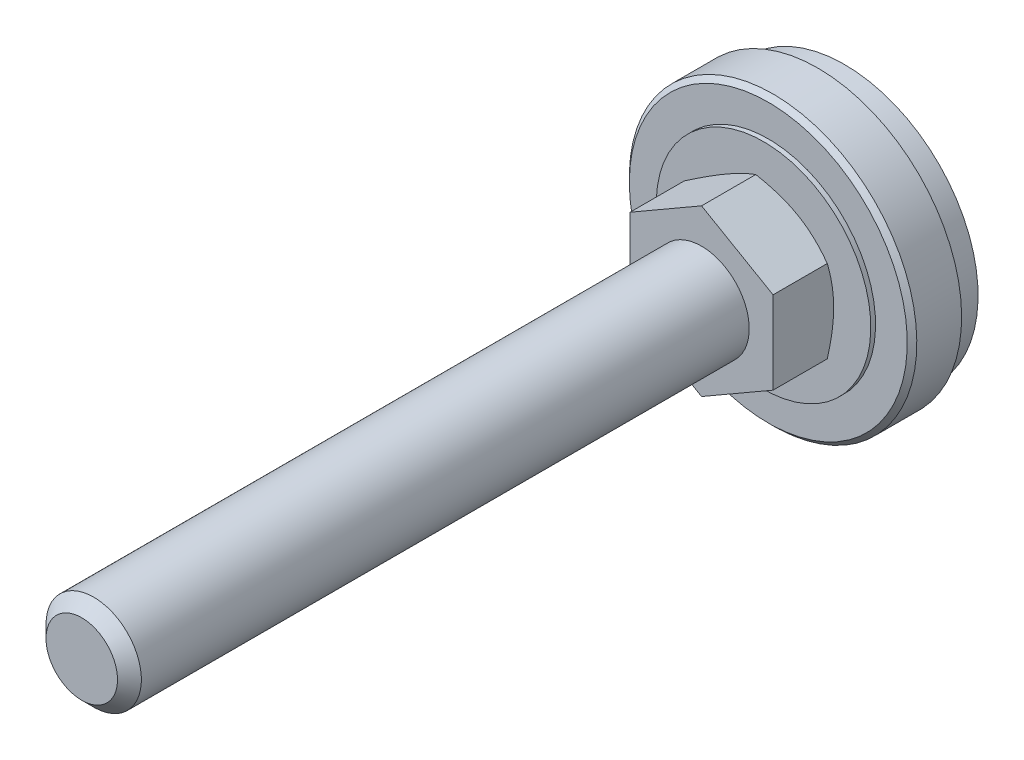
ISO-10303-21;
HEADER;
FILE_DESCRIPTION(('STEP AP214'),'2;1');
FILE_NAME('part.step','',(''),(''),'','','');
FILE_SCHEMA(('AUTOMOTIVE_DESIGN { 1 0 10303 214 1 1 1 1 }'));
ENDSEC;
DATA;
#1=APPLICATION_CONTEXT('core data for automotive mechanical design processes');
#2=APPLICATION_PROTOCOL_DEFINITION('international standard','automotive_design',2000,#1);
#3=PRODUCT_CONTEXT('',#1,'mechanical');
#4=PRODUCT('Part','Part','',(#3));
#5=PRODUCT_RELATED_PRODUCT_CATEGORY('part','',(#4));
#6=PRODUCT_DEFINITION_FORMATION('','',#4);
#7=PRODUCT_DEFINITION_CONTEXT('part definition',#1,'design');
#8=PRODUCT_DEFINITION('design','',#6,#7);
#9=PRODUCT_DEFINITION_SHAPE('','',#8);
#10=(LENGTH_UNIT() NAMED_UNIT(*) SI_UNIT(.MILLI.,.METRE.));
#11=(NAMED_UNIT(*) PLANE_ANGLE_UNIT() SI_UNIT($,.RADIAN.));
#12=(NAMED_UNIT(*) SI_UNIT($,.STERADIAN.) SOLID_ANGLE_UNIT());
#13=UNCERTAINTY_MEASURE_WITH_UNIT(LENGTH_MEASURE(1.E-05),#10,'distance_accuracy_value','');
#14=(GEOMETRIC_REPRESENTATION_CONTEXT(3) GLOBAL_UNCERTAINTY_ASSIGNED_CONTEXT((#13)) GLOBAL_UNIT_ASSIGNED_CONTEXT((#10,
#11,#12)) REPRESENTATION_CONTEXT('',''));
#15=CARTESIAN_POINT('',(0.,0.,0.));
#16=DIRECTION('',(0.,0.,1.));
#17=DIRECTION('',(1.,0.,0.));
#18=AXIS2_PLACEMENT_3D('',#15,#16,#17);
#19=CARTESIAN_POINT('',(0.,0.,30.));
#20=DIRECTION('',(0.,0.,1.));
#21=DIRECTION('',(0.5,-0.866025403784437,0.));
#22=AXIS2_PLACEMENT_3D('',#19,#20,#21);
#23=PLANE('',#22);
#24=DIRECTION('',(0.,1.,0.));
#25=VECTOR('',#24,1.);
#26=CARTESIAN_POINT('',(15.,-8.66025403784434,30.));
#27=LINE('',#26,#25);
#28=CARTESIAN_POINT('',(15.,-8.66025403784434,30.));
#29=VERTEX_POINT('',#28);
#30=CARTESIAN_POINT('',(15.,8.66025403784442,30.));
#31=VERTEX_POINT('',#30);
#32=EDGE_CURVE('E226',#29,#31,#27,.T.);
#33=ORIENTED_EDGE('',*,*,#32,.T.);
#34=DIRECTION('',(-0.86602540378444,0.5,0.));
#35=VECTOR('',#34,1.);
#36=CARTESIAN_POINT('',(15.,8.66025403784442,30.));
#37=LINE('',#36,#35);
#38=CARTESIAN_POINT('',(0.,17.3205080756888,30.));
#39=VERTEX_POINT('',#38);
#40=EDGE_CURVE('E373',#31,#39,#37,.T.);
#41=ORIENTED_EDGE('',*,*,#40,.T.);
#42=DIRECTION('',(-0.866025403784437,-0.5,0.));
#43=VECTOR('',#42,1.);
#44=CARTESIAN_POINT('',(0.,17.3205080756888,30.));
#45=LINE('',#44,#43);
#46=CARTESIAN_POINT('',(-15.,8.66025403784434,30.));
#47=VERTEX_POINT('',#46);
#48=EDGE_CURVE('E372',#39,#47,#45,.T.);
#49=ORIENTED_EDGE('',*,*,#48,.T.);
#50=DIRECTION('',(0.,-1.,0.));
#51=VECTOR('',#50,1.);
#52=CARTESIAN_POINT('',(-15.,8.66025403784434,30.));
#53=LINE('',#52,#51);
#54=CARTESIAN_POINT('',(-15.,-8.66025403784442,30.));
#55=VERTEX_POINT('',#54);
#56=EDGE_CURVE('E377',#47,#55,#53,.T.);
#57=ORIENTED_EDGE('',*,*,#56,.T.);
#58=DIRECTION('',(0.86602540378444,-0.5,0.));
#59=VECTOR('',#58,1.);
#60=CARTESIAN_POINT('',(-15.,-8.66025403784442,30.));
#61=LINE('',#60,#59);
#62=CARTESIAN_POINT('',(0.,-17.3205080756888,30.));
#63=VERTEX_POINT('',#62);
#64=EDGE_CURVE('E379',#55,#63,#61,.T.);
#65=ORIENTED_EDGE('',*,*,#64,.T.);
#66=DIRECTION('',(0.866025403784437,0.5,0.));
#67=VECTOR('',#66,1.);
#68=CARTESIAN_POINT('',(0.,-17.3205080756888,30.));
#69=LINE('',#68,#67);
#70=EDGE_CURVE('E37',#63,#29,#69,.T.);
#71=ORIENTED_EDGE('',*,*,#70,.T.);
#72=EDGE_LOOP('',(#33,#41,#49,#57,#65,#71));
#73=FACE_BOUND('',#72,.T.);
#74=CARTESIAN_POINT('',(0.,0.,30.));
#75=DIRECTION('',(0.,0.,1.));
#76=DIRECTION('',(0.5,-0.866025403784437,0.));
#77=AXIS2_PLACEMENT_3D('',#74,#75,#76);
#78=CIRCLE('',#77,10.);
#79=CARTESIAN_POINT('',(5.,-8.66025403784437,30.));
#80=VERTEX_POINT('',#79);
#81=EDGE_CURVE('E230',#80,#80,#78,.T.);
#82=ORIENTED_EDGE('',*,*,#81,.F.);
#83=EDGE_LOOP('',(#82));
#84=FACE_BOUND('',#83,.T.);
#85=ADVANCED_FACE('F14',(#73,#84),#23,.T.);
#86=CARTESIAN_POINT('',(-11.25,19.4855715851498,17.));
#87=DIRECTION('',(0.,0.,1.));
#88=DIRECTION('',(0.5,-0.866025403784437,0.));
#89=AXIS2_PLACEMENT_3D('',#86,#87,#88);
#90=PLANE('',#89);
#91=CARTESIAN_POINT('',(0.,0.,17.));
#92=DIRECTION('',(0.,0.,1.));
#93=DIRECTION('',(0.5,-0.866025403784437,0.));
#94=AXIS2_PLACEMENT_3D('',#91,#92,#93);
#95=CIRCLE('',#94,22.5);
#96=CARTESIAN_POINT('',(11.25,-19.4855715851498,17.));
#97=VERTEX_POINT('',#96);
#98=EDGE_CURVE('E102',#97,#97,#95,.T.);
#99=ORIENTED_EDGE('',*,*,#98,.T.);
#100=EDGE_LOOP('',(#99));
#101=FACE_BOUND('',#100,.T.);
#102=CARTESIAN_POINT('',(0.,0.,17.));
#103=DIRECTION('',(0.,0.,-1.));
#104=DIRECTION('',(-0.5,0.866025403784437,0.));
#105=AXIS2_PLACEMENT_3D('',#102,#103,#104);
#106=CIRCLE('',#105,14.5);
#107=CARTESIAN_POINT('',(-7.25,12.5573683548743,17.));
#108=VERTEX_POINT('',#107);
#109=EDGE_CURVE('E84',#108,#108,#106,.T.);
#110=ORIENTED_EDGE('',*,*,#109,.T.);
#111=EDGE_LOOP('',(#110));
#112=FACE_BOUND('',#111,.T.);
#113=ADVANCED_FACE('F186',(#101,#112),#90,.T.);
#114=CARTESIAN_POINT('',(0.,0.,0.));
#115=DIRECTION('',(0.,0.,-1.));
#116=DIRECTION('',(-0.5,0.866025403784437,0.));
#117=AXIS2_PLACEMENT_3D('',#114,#115,#116);
#118=PLANE('',#117);
#119=CARTESIAN_POINT('',(0.,0.,0.));
#120=DIRECTION('',(0.,0.,1.));
#121=DIRECTION('',(0.5,-0.866025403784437,0.));
#122=AXIS2_PLACEMENT_3D('',#119,#120,#121);
#123=CIRCLE('',#122,28.);
#124=CARTESIAN_POINT('',(14.,-24.2487113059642,0.));
#125=VERTEX_POINT('',#124);
#126=EDGE_CURVE('E73',#125,#125,#123,.T.);
#127=ORIENTED_EDGE('',*,*,#126,.F.);
#128=EDGE_LOOP('',(#127));
#129=FACE_BOUND('',#128,.T.);
#130=ADVANCED_FACE('F189',(#129),#118,.T.);
#131=CARTESIAN_POINT('',(0.,0.,134.742297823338));
#132=DIRECTION('',(0.,0.,1.));
#133=DIRECTION('',(0.5,-0.866025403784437,0.));
#134=AXIS2_PLACEMENT_3D('',#131,#132,#133);
#135=CYLINDRICAL_SURFACE('',#134,28.);
#136=ORIENTED_EDGE('',*,*,#126,.T.);
#137=EDGE_LOOP('',(#136));
#138=FACE_BOUND('',#137,.T.);
#139=CARTESIAN_POINT('',(0.,0.,5.6));
#140=DIRECTION('',(0.,0.,1.));
#141=DIRECTION('',(0.5,-0.866025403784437,0.));
#142=AXIS2_PLACEMENT_3D('',#139,#140,#141);
#143=CIRCLE('',#142,28.);
#144=CARTESIAN_POINT('',(14.,-24.2487113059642,5.6));
#145=VERTEX_POINT('',#144);
#146=EDGE_CURVE('E117',#145,#145,#143,.T.);
#147=ORIENTED_EDGE('',*,*,#146,.F.);
#148=EDGE_LOOP('',(#147));
#149=FACE_BOUND('',#148,.T.);
#150=ADVANCED_FACE('F209',(#138,#149),#135,.T.);
#151=CARTESIAN_POINT('',(-15.075,26.1106659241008,5.6));
#152=DIRECTION('',(0.,0.,-1.));
#153=DIRECTION('',(-0.5,0.866025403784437,0.));
#154=AXIS2_PLACEMENT_3D('',#151,#152,#153);
#155=PLANE('',#154);
#156=ORIENTED_EDGE('',*,*,#146,.T.);
#157=EDGE_LOOP('',(#156));
#158=FACE_BOUND('',#157,.T.);
#159=CARTESIAN_POINT('',(0.,0.,5.6));
#160=DIRECTION('',(0.,0.,1.));
#161=DIRECTION('',(0.5,-0.866025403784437,0.));
#162=AXIS2_PLACEMENT_3D('',#159,#160,#161);
#163=CIRCLE('',#162,30.15);
#164=CARTESIAN_POINT('',(15.075,-26.1106659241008,5.6));
#165=VERTEX_POINT('',#164);
#166=EDGE_CURVE('E114',#165,#165,#163,.T.);
#167=ORIENTED_EDGE('',*,*,#166,.F.);
#168=EDGE_LOOP('',(#167));
#169=FACE_BOUND('',#168,.T.);
#170=ADVANCED_FACE('F205',(#158,#169),#155,.T.);
#171=CARTESIAN_POINT('',(0.,0.,134.742297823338));
#172=DIRECTION('',(0.,0.,1.));
#173=DIRECTION('',(0.5,-0.866025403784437,0.));
#174=AXIS2_PLACEMENT_3D('',#171,#172,#173);
#175=CYLINDRICAL_SURFACE('',#174,30.15);
#176=ORIENTED_EDGE('',*,*,#166,.T.);
#177=EDGE_LOOP('',(#176));
#178=FACE_BOUND('',#177,.T.);
#179=CARTESIAN_POINT('',(0.,0.,15.));
#180=DIRECTION('',(0.,0.,1.));
#181=DIRECTION('',(0.5,-0.866025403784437,0.));
#182=AXIS2_PLACEMENT_3D('',#179,#180,#181);
#183=CIRCLE('',#182,30.15);
#184=CARTESIAN_POINT('',(15.075,-26.1106659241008,15.));
#185=VERTEX_POINT('',#184);
#186=EDGE_CURVE('E111',#185,#185,#183,.T.);
#187=ORIENTED_EDGE('',*,*,#186,.F.);
#188=EDGE_LOOP('',(#187));
#189=FACE_BOUND('',#188,.T.);
#190=ADVANCED_FACE('F201',(#178,#189),#175,.T.);
#191=CARTESIAN_POINT('',(0.,0.,16.));
#192=DIRECTION('',(0.,0.,-1.));
#193=DIRECTION('',(-0.5,0.866025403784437,0.));
#194=AXIS2_PLACEMENT_3D('',#191,#192,#193);
#195=CONICAL_SURFACE('',#194,29.15,0.785398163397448);
#196=ORIENTED_EDGE('',*,*,#186,.T.);
#197=EDGE_LOOP('',(#196));
#198=FACE_BOUND('',#197,.T.);
#199=CARTESIAN_POINT('',(0.,0.,16.));
#200=DIRECTION('',(0.,0.,1.));
#201=DIRECTION('',(0.5,-0.866025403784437,0.));
#202=AXIS2_PLACEMENT_3D('',#199,#200,#201);
#203=CIRCLE('',#202,29.15);
#204=CARTESIAN_POINT('',(14.575,-25.2446405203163,16.));
#205=VERTEX_POINT('',#204);
#206=EDGE_CURVE('E108',#205,#205,#203,.T.);
#207=ORIENTED_EDGE('',*,*,#206,.F.);
#208=EDGE_LOOP('',(#207));
#209=FACE_BOUND('',#208,.T.);
#210=ADVANCED_FACE('F197',(#198,#209),#195,.T.);
#211=CARTESIAN_POINT('',(-14.575,25.2446405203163,16.));
#212=DIRECTION('',(0.,0.,1.));
#213=DIRECTION('',(0.5,-0.866025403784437,0.));
#214=AXIS2_PLACEMENT_3D('',#211,#212,#213);
#215=PLANE('',#214);
#216=ORIENTED_EDGE('',*,*,#206,.T.);
#217=EDGE_LOOP('',(#216));
#218=FACE_BOUND('',#217,.T.);
#219=CARTESIAN_POINT('',(0.,0.,16.));
#220=DIRECTION('',(0.,0.,1.));
#221=DIRECTION('',(0.5,-0.866025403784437,0.));
#222=AXIS2_PLACEMENT_3D('',#219,#220,#221);
#223=CIRCLE('',#222,22.5);
#224=CARTESIAN_POINT('',(11.25,-19.4855715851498,16.));
#225=VERTEX_POINT('',#224);
#226=EDGE_CURVE('E105',#225,#225,#223,.T.);
#227=ORIENTED_EDGE('',*,*,#226,.F.);
#228=EDGE_LOOP('',(#227));
#229=FACE_BOUND('',#228,.T.);
#230=ADVANCED_FACE('F193',(#218,#229),#215,.T.);
#231=CARTESIAN_POINT('',(0.,0.,134.742297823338));
#232=DIRECTION('',(0.,0.,1.));
#233=DIRECTION('',(0.5,-0.866025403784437,0.));
#234=AXIS2_PLACEMENT_3D('',#231,#232,#233);
#235=CYLINDRICAL_SURFACE('',#234,22.5);
#236=ORIENTED_EDGE('',*,*,#226,.T.);
#237=EDGE_LOOP('',(#236));
#238=FACE_BOUND('',#237,.T.);
#239=ORIENTED_EDGE('',*,*,#98,.F.);
#240=EDGE_LOOP('',(#239));
#241=FACE_BOUND('',#240,.T.);
#242=ADVANCED_FACE('F133',(#238,#241),#235,.T.);
#243=CARTESIAN_POINT('',(0.,0.,22.4252428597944));
#244=DIRECTION('',(0.,0.,1.));
#245=DIRECTION('',(0.5,-0.866025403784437,0.));
#246=AXIS2_PLACEMENT_3D('',#243,#244,#245);
#247=CONICAL_SURFACE('',#246,23.8967962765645,1.0471975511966);
#248=ORIENTED_EDGE('',*,*,#109,.F.);
#249=EDGE_LOOP('',(#248));
#250=FACE_BOUND('',#249,.T.);
#251=CARTESIAN_POINT('',(-12.8156002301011,-24.7195983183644,24.7042637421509));
#252=CARTESIAN_POINT('',(-12.531199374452,-24.5553994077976,24.5445303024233));
#253=CARTESIAN_POINT('',(-12.2464693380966,-24.3910104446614,24.3855786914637));
#254=CARTESIAN_POINT('',(-11.6762822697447,-24.0618127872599,24.0694158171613));
#255=CARTESIAN_POINT('',(-11.3908252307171,-23.8970040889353,23.9122045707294));
#256=CARTESIAN_POINT('',(-10.5331869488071,-23.4018463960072,23.443406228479));
#257=CARTESIAN_POINT('',(-9.95982008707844,-23.0708128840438,23.1347004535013));
#258=CARTESIAN_POINT('',(-8.80626593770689,-22.4048080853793,22.5251819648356));
#259=CARTESIAN_POINT('',(-8.22605861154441,-22.0698252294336,22.2244196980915));
#260=CARTESIAN_POINT('',(-7.06108881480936,-21.3972296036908,21.6349394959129));
#261=CARTESIAN_POINT('',(-6.47632655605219,-21.0596169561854,21.3462210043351));
#262=CARTESIAN_POINT('',(-5.28180185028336,-20.3699577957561,20.7746714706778));
#263=CARTESIAN_POINT('',(-4.67185404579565,-20.0178042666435,20.49235431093));
#264=CARTESIAN_POINT('',(-3.44488115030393,-19.309411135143,19.9486150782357));
#265=CARTESIAN_POINT('',(-2.82785528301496,-18.9531710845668,19.6871953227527));
#266=CARTESIAN_POINT('',(-1.58686537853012,-18.2366852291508,19.1919746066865));
#267=CARTESIAN_POINT('',(-0.96291770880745,-17.8764488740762,18.9581193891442));
#268=CARTESIAN_POINT('',(0.293985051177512,-17.1507757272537,18.5253878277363));
#269=CARTESIAN_POINT('',(0.926937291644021,-16.7853405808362,18.3265006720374));
#270=CARTESIAN_POINT('',(1.88148437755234,-16.2342325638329,18.0620414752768));
#271=CARTESIAN_POINT('',(2.19961844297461,-16.0505577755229,17.9797180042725));
#272=CARTESIAN_POINT('',(2.83809132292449,-15.6819352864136,17.8273230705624));
#273=CARTESIAN_POINT('',(3.15843009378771,-15.4969876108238,17.757251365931));
#274=CARTESIAN_POINT('',(3.80110433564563,-15.1259394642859,17.6305843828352));
#275=CARTESIAN_POINT('',(4.12343977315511,-14.9398390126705,17.5739888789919));
#276=CARTESIAN_POINT('',(4.76977798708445,-14.5666754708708,17.4753959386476));
#277=CARTESIAN_POINT('',(5.09378068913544,-14.3796124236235,17.4333978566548));
#278=CARTESIAN_POINT('',(5.73869803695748,-14.0072692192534,17.3653714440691));
#279=CARTESIAN_POINT('',(6.05959634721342,-13.8219984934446,17.3391378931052));
#280=CARTESIAN_POINT('',(6.70206615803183,-13.4510683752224,17.3023738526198));
#281=CARTESIAN_POINT('',(7.02363764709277,-13.2654089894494,17.2918430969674));
#282=CARTESIAN_POINT('',(7.66687876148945,-12.8940335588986,17.2867359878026));
#283=CARTESIAN_POINT('',(7.98854838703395,-12.7083175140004,17.2921596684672));
#284=CARTESIAN_POINT('',(8.63139929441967,-12.3371673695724,17.3188268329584));
#285=CARTESIAN_POINT('',(8.95258055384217,-12.1517332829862,17.3400710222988));
#286=CARTESIAN_POINT('',(9.71937227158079,-11.7090258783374,17.4092190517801));
#287=CARTESIAN_POINT('',(10.1645061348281,-11.4520277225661,17.4643010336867));
#288=CARTESIAN_POINT('',(11.0515840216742,-10.9398730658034,17.6018992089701));
#289=CARTESIAN_POINT('',(11.4935276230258,-10.6847168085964,17.6844189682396));
#290=CARTESIAN_POINT('',(12.3737638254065,-10.1765122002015,17.8739575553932));
#291=CARTESIAN_POINT('',(12.8120534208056,-9.92346558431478,17.9809948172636));
#292=CARTESIAN_POINT('',(13.6842925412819,-9.41987809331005,18.2162917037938));
#293=CARTESIAN_POINT('',(14.1182421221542,-9.16933718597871,18.3445510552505));
#294=CARTESIAN_POINT('',(14.9915095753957,-8.66515598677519,18.6222437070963));
#295=CARTESIAN_POINT('',(15.4307286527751,-8.41157273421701,18.7720883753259));
#296=CARTESIAN_POINT('',(16.3048424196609,-7.90690291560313,19.0876591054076));
#297=CARTESIAN_POINT('',(16.7397370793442,-7.65581636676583,19.253385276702));
#298=CARTESIAN_POINT('',(17.605411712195,-7.15601888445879,19.5980527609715));
#299=CARTESIAN_POINT('',(18.0361929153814,-6.90730724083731,19.7769899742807));
#300=CARTESIAN_POINT('',(18.8941620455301,-6.41195853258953,20.1459352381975));
#301=CARTESIAN_POINT('',(19.3213500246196,-6.16532143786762,20.335943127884));
#302=CARTESIAN_POINT('',(20.3671937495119,-5.56150328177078,20.8142166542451));
#303=CARTESIAN_POINT('',(20.9840653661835,-5.20535228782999,21.1076776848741));
#304=CARTESIAN_POINT('',(22.21222970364,-4.49627127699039,21.7098205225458));
#305=CARTESIAN_POINT('',(22.8235220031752,-4.14334150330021,22.0185034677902));
#306=CARTESIAN_POINT('',(24.041630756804,-3.44006608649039,22.64789067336));
#307=CARTESIAN_POINT('',(24.6484459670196,-3.08972116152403,22.9685981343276));
#308=CARTESIAN_POINT('',(25.8582248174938,-2.39125501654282,23.6194839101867));
#309=CARTESIAN_POINT('',(26.4611885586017,-2.0431337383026,23.9496619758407));
#310=CARTESIAN_POINT('',(27.6646871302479,-1.34829351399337,24.6180526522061));
#311=CARTESIAN_POINT('',(28.2652179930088,-1.00157685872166,24.9562747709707));
#312=CARTESIAN_POINT('',(29.4636269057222,-0.309675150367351,25.6389282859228));
#313=CARTESIAN_POINT('',(30.0615049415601,0.0355098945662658,25.9833597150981));
#314=CARTESIAN_POINT('',(31.2549440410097,0.724542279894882,26.6772703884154));
#315=CARTESIAN_POINT('',(31.8505054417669,1.06838981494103,27.0267488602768));
#316=CARTESIAN_POINT('',(33.0397454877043,1.75499787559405,27.729943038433));
#317=CARTESIAN_POINT('',(33.633424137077,2.0977584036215,28.0836587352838));
#318=CARTESIAN_POINT('',(35.3053941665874,3.06307075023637,29.0861455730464));
#319=CARTESIAN_POINT('',(36.3818468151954,3.68456097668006,29.7390052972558));
#320=CARTESIAN_POINT('',(38.5308195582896,4.92527096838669,31.0534039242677));
#321=CARTESIAN_POINT('',(39.6033394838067,5.54449063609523,31.7149431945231));
#322=CARTESIAN_POINT('',(41.7423385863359,6.77944234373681,33.0427714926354));
#323=CARTESIAN_POINT('',(42.8088262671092,7.3951792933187,33.7090422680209));
#324=CARTESIAN_POINT('',(44.4067215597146,8.31772457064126,34.7122533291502));
#325=CARTESIAN_POINT('',(44.9390311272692,8.62505364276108,35.0472809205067));
#326=CARTESIAN_POINT('',(46.0031101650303,9.23939996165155,35.7184756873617));
#327=CARTESIAN_POINT('',(46.5348796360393,9.54641720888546,36.054642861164));
#328=CARTESIAN_POINT('',(47.0664104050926,9.85329664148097,36.3913126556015));
#329=B_SPLINE_CURVE_WITH_KNOTS('',3,(#251,#252,#253,#254,#255,#256,#257,#258,#259,#260,#261,
#262,#263,#264,#265,#266,#267,#268,#269,#270,#271,#272,#273,#274,#275,#276,#277,#278,#279,#280,
#281,#282,#283,#284,#285,#286,#287,#288,#289,#290,#291,#292,#293,#294,#295,#296,#297,#298,#299,
#300,#301,#302,#303,#304,#305,#306,#307,#308,#309,#310,#311,#312,#313,#314,#315,#316,#317,#318,
#319,#320,#321,#322,#323,#324,#325,#326,#327,#328),.UNSPECIFIED.,.F.,.F.,(4,2,2,2,2,2,2,2,2,2,2,
2,2,2,2,2,2,2,2,2,2,2,2,2,2,2,2,2,2,2,2,2,2,2,2,2,2,2,4),(0.,1.0955523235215,2.19111528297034,
4.38255547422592,6.58559894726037,8.78854057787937,11.0646358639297,13.340983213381,
15.612772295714,17.8838577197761,19.0130694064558,20.1422587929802,21.2714292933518,
22.400549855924,23.5146339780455,24.6286992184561,25.7427668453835,26.8568841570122,
28.4068489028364,29.9570151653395,31.5083508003,33.059666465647,34.645875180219,
36.2320948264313,37.817824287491,39.4035307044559,41.7144394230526,44.0255212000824,
46.3372225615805,48.6488631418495,50.9633871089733,53.2779233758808,55.5921091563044,
57.9062897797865,62.1182482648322,66.330385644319,70.5308455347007,72.6309477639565,
74.7310468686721),.UNSPECIFIED.);
#330=CARTESIAN_POINT('',(0.,-17.3205080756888,18.6284210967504));
#331=VERTEX_POINT('',#330);
#332=CARTESIAN_POINT('',(15.,-8.66025403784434,18.6284210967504));
#333=VERTEX_POINT('',#332);
#334=EDGE_CURVE('E65',#331,#333,#329,.T.);
#335=ORIENTED_EDGE('',*,*,#334,.F.);
#336=CARTESIAN_POINT('',(-15.0002,-8.66013856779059,18.6284877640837));
#337=CARTESIAN_POINT('',(-14.6705058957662,-8.8504875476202,18.5185969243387));
#338=CARTESIAN_POINT('',(-14.3395258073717,-9.04157899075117,18.4136927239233));
#339=CARTESIAN_POINT('',(-13.674911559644,-9.42529420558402,18.2152437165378));
#340=CARTESIAN_POINT('',(-13.3412765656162,-9.61791845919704,18.1217026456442));
#341=CARTESIAN_POINT('',(-12.6707077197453,-10.0050715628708,17.9472372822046));
#342=CARTESIAN_POINT('',(-12.333767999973,-10.199603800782,17.8663428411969));
#343=CARTESIAN_POINT('',(-11.6575472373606,-10.5900200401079,17.7189077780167));
#344=CARTESIAN_POINT('',(-11.3182663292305,-10.7859039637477,17.652366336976));
#345=CARTESIAN_POINT('',(-10.6460568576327,-11.1740042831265,17.536467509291));
#346=CARTESIAN_POINT('',(-10.3131781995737,-11.3661918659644,17.4867265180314));
#347=CARTESIAN_POINT('',(-9.64589556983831,-11.7514476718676,17.4033218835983));
#348=CARTESIAN_POINT('',(-9.31149156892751,-11.9445159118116,17.3696585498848));
#349=CARTESIAN_POINT('',(-8.64212181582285,-12.3309767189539,17.3192592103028));
#350=CARTESIAN_POINT('',(-8.30715720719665,-12.5243686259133,17.3025030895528));
#351=CARTESIAN_POINT('',(-7.63691878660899,-12.9113309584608,17.2862785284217));
#352=CARTESIAN_POINT('',(-7.30164498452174,-13.1049013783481,17.2868095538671));
#353=CARTESIAN_POINT('',(-6.67485311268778,-13.4667798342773,17.3039517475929));
#354=CARTESIAN_POINT('',(-6.38329037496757,-13.6351136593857,17.3184719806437));
#355=CARTESIAN_POINT('',(-5.80083556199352,-13.9713941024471,17.3603122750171));
#356=CARTESIAN_POINT('',(-5.50994353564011,-14.1393406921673,17.3876332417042));
#357=CARTESIAN_POINT('',(-4.92898814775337,-14.4747554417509,17.4545986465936));
#358=CARTESIAN_POINT('',(-4.63892567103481,-14.6422230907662,17.4942532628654));
#359=CARTESIAN_POINT('',(-4.06016058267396,-14.9763732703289,17.5851902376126));
#360=CARTESIAN_POINT('',(-3.77145806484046,-15.1430557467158,17.636473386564));
#361=CARTESIAN_POINT('',(-2.89508556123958,-15.6490296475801,17.8090619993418));
#362=CARTESIAN_POINT('',(-2.30995340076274,-15.9868558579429,17.9475763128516));
#363=CARTESIAN_POINT('',(-1.14841408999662,-16.6574708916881,18.2619471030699));
#364=CARTESIAN_POINT('',(-0.571992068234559,-16.9902683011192,18.4377297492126));
#365=CARTESIAN_POINT('',(0.000200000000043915,-17.3206235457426,18.6284877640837));
#366=B_SPLINE_CURVE_WITH_KNOTS('',3,(#336,#337,#338,#339,#340,#341,#342,#343,#344,#345,#346,
#347,#348,#349,#350,#351,#352,#353,#354,#355,#356,#357,#358,#359,#360,#361,#362,#363,#364,#365),
.UNSPECIFIED.,.F.,.F.,(4,2,2,2,2,2,2,2,2,2,2,2,2,2,4),(0.,1.18875411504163,2.37789802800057,
3.56980778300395,4.76164951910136,5.92407379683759,7.08652044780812,8.24758247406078,
9.40860862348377,10.4193068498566,11.4300765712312,12.4416826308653,13.4533574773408,
15.5211962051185,17.5849760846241),.UNSPECIFIED.);
#367=CARTESIAN_POINT('',(-15.,-8.66025403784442,18.6284210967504));
#368=VERTEX_POINT('',#367);
#369=EDGE_CURVE('E68',#368,#331,#366,.T.);
#370=ORIENTED_EDGE('',*,*,#369,.F.);
#371=CARTESIAN_POINT('',(-15.,8.66048497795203,18.6284877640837));
#372=CARTESIAN_POINT('',(-15.,8.27978701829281,18.5185969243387));
#373=CARTESIAN_POINT('',(-15.,7.89760413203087,18.4136927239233));
#374=CARTESIAN_POINT('',(-15.,7.13017370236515,18.2152437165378));
#375=CARTESIAN_POINT('',(-15.,6.74492519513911,18.1217026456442));
#376=CARTESIAN_POINT('',(-15.,5.9706189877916,17.9472372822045));
#377=CARTESIAN_POINT('',(-15.,5.58155451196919,17.8663428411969));
#378=CARTESIAN_POINT('',(-15.,4.80072203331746,17.7189077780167));
#379=CARTESIAN_POINT('',(-15.,4.4089541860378,17.652366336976));
#380=CARTESIAN_POINT('',(-15.,3.63275354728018,17.536467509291));
#381=CARTESIAN_POINT('',(-15.,3.24837838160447,17.4867265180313));
#382=CARTESIAN_POINT('',(-15.,2.47786676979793,17.4033218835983));
#383=CARTESIAN_POINT('',(-15.,2.09173028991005,17.3696585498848));
#384=CARTESIAN_POINT('',(-15.,1.31880867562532,17.3192592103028));
#385=CARTESIAN_POINT('',(-15.,0.932024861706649,17.3025030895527));
#386=CARTESIAN_POINT('',(-15.,0.158100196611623,17.2862785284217));
#387=CARTESIAN_POINT('',(-15.,-0.229040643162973,17.2868095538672));
#388=CARTESIAN_POINT('',(-15.,-0.952797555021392,17.3039517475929));
#389=CARTESIAN_POINT('',(-15.,-1.28946520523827,17.3184719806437));
#390=CARTESIAN_POINT('',(-15.,-1.962026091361,17.3603122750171));
#391=CARTESIAN_POINT('',(-15.,-2.29791927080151,17.3876332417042));
#392=CARTESIAN_POINT('',(-15.,-2.96874876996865,17.4545986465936));
#393=CARTESIAN_POINT('',(-15.,-3.30368406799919,17.4942532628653));
#394=CARTESIAN_POINT('',(-15.,-3.97198442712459,17.5851902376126));
#395=CARTESIAN_POINT('',(-15.,-4.30534937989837,17.6364733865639));
#396=CARTESIAN_POINT('',(-15.,-5.31729718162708,17.8090619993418));
#397=CARTESIAN_POINT('',(-15.,-5.99294960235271,17.9475763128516));
#398=CARTESIAN_POINT('',(-15.,-7.334179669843,18.2619471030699));
#399=CARTESIAN_POINT('',(-15.,-7.9997744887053,18.4377297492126));
#400=CARTESIAN_POINT('',(-15.,-8.6604849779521,18.6284877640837));
#401=B_SPLINE_CURVE_WITH_KNOTS('',3,(#371,#372,#373,#374,#375,#376,#377,#378,#379,#380,#381,
#382,#383,#384,#385,#386,#387,#388,#389,#390,#391,#392,#393,#394,#395,#396,#397,#398,#399,#400),
.UNSPECIFIED.,.F.,.F.,(4,2,2,2,2,2,2,2,2,2,2,2,2,2,4),(0.,1.18875411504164,2.37789802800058,
3.56980778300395,4.76164951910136,5.92407379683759,7.08652044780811,8.24758247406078,
9.40860862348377,10.4193068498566,11.4300765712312,12.4416826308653,13.4533574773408,
15.5211962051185,17.5849760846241),.UNSPECIFIED.);
#402=CARTESIAN_POINT('',(-15.,8.66025403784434,18.6284210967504));
#403=VERTEX_POINT('',#402);
#404=EDGE_CURVE('E83',#403,#368,#401,.T.);
#405=ORIENTED_EDGE('',*,*,#404,.F.);
#406=CARTESIAN_POINT('',(-27.8156002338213,1.26116379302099,24.7042637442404));
#407=CARTESIAN_POINT('',(-27.5311993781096,1.42536270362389,24.5445303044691));
#408=CARTESIAN_POINT('',(-27.2464693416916,1.5897516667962,24.3855786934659));
#409=CARTESIAN_POINT('',(-26.6762822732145,1.91894932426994,24.0694158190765));
#410=CARTESIAN_POINT('',(-26.3908252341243,2.08375802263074,23.912204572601));
#411=CARTESIAN_POINT('',(-25.5331869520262,2.57891571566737,23.4434062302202));
#412=CARTESIAN_POINT('',(-24.959820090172,2.9099492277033,23.1347004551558));
#413=CARTESIAN_POINT('',(-23.8062659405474,3.57595402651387,22.5251819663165));
#414=CARTESIAN_POINT('',(-23.2260586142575,3.91093688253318,22.2244196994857));
#415=CARTESIAN_POINT('',(-22.0610888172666,4.58353250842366,21.6349394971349));
#416=CARTESIAN_POINT('',(-21.476326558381,4.92114515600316,21.3462210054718));
#417=CARTESIAN_POINT('',(-20.2818018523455,5.61080431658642,20.7746714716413));
#418=CARTESIAN_POINT('',(-19.6718540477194,5.96295784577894,20.4923543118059));
#419=CARTESIAN_POINT('',(-18.4448811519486,6.67135097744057,19.9486150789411));
#420=CARTESIAN_POINT('',(-17.827855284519,7.02759102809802,19.6871953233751));
#421=CARTESIAN_POINT('',(-16.5868653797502,7.74407688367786,19.1919746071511));
#422=CARTESIAN_POINT('',(-15.9629177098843,8.10431323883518,18.9581193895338));
#423=CARTESIAN_POINT('',(-14.706014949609,8.82998638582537,18.5253878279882));
#424=CARTESIAN_POINT('',(-14.0730627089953,9.19542153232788,18.3265006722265));
#425=CARTESIAN_POINT('',(-13.1185156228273,9.74652954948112,18.062041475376));
#426=CARTESIAN_POINT('',(-12.800381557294,9.93020433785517,17.9797180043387));
#427=CARTESIAN_POINT('',(-12.1619086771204,10.2988268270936,17.8273230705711));
#428=CARTESIAN_POINT('',(-11.8415699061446,10.4837745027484,17.757251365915));
#429=CARTESIAN_POINT('',(-11.1988956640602,10.8548226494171,17.6305843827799));
#430=CARTESIAN_POINT('',(-10.8765602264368,11.0409231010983,17.5739888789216));
#431=CARTESIAN_POINT('',(-10.2302220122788,11.41408664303,17.4753959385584));
#432=CARTESIAN_POINT('',(-9.906219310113,11.6011496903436,17.4333978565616));
#433=CARTESIAN_POINT('',(-9.26130196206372,11.9734928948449,17.3653714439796));
#434=CARTESIAN_POINT('',(-8.94040365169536,12.1587636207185,17.3391378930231));
#435=CARTESIAN_POINT('',(-8.29793384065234,12.5296937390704,17.3023738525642));
#436=CARTESIAN_POINT('',(-7.97636235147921,12.7153531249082,17.2918430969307));
#437=CARTESIAN_POINT('',(-7.33312123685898,13.0867285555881,17.2867359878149));
#438=CARTESIAN_POINT('',(-7.01145161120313,13.2724446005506,17.2921596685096));
#439=CARTESIAN_POINT('',(-6.36860070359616,13.6435947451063,17.3188268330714));
#440=CARTESIAN_POINT('',(-6.04741944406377,13.829028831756,17.3400710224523));
#441=CARTESIAN_POINT('',(-5.28062772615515,14.2717362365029,17.4092190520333));
#442=CARTESIAN_POINT('',(-4.8354938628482,14.5287343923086,17.4643010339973));
#443=CARTESIAN_POINT('',(-3.94841597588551,15.0408890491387,17.6018992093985));
#444=CARTESIAN_POINT('',(-3.50647237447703,15.2960453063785,17.6844189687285));
#445=CARTESIAN_POINT('',(-2.62623617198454,15.804249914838,17.8739575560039));
#446=CARTESIAN_POINT('',(-2.18794657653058,16.0572965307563,17.9809948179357));
#447=CARTESIAN_POINT('',(-1.31570745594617,16.5608840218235,18.2162917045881));
#448=CARTESIAN_POINT('',(-0.88175787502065,16.8114249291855,18.3445510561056));
#449=CARTESIAN_POINT('',(-0.00849042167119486,17.3156061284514,18.6222437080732));
#450=CARTESIAN_POINT('',(0.430728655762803,17.5691893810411,18.772088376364));
#451=CARTESIAN_POINT('',(1.30484242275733,18.0738591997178,19.087659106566));
#452=CARTESIAN_POINT('',(1.73973708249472,18.3249457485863,19.2533852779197));
#453=CARTESIAN_POINT('',(2.60541171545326,18.8247432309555,19.5980527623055));
#454=CARTESIAN_POINT('',(3.03619291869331,19.073454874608,19.7769899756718));
#455=CARTESIAN_POINT('',(3.89416204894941,19.5688035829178,20.145935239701));
#456=CARTESIAN_POINT('',(4.32135002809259,19.8154406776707,20.3359431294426));
#457=CARTESIAN_POINT('',(5.36719375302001,20.4192588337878,20.8142166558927));
#458=CARTESIAN_POINT('',(5.98406536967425,20.7754098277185,21.1076776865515));
#459=CARTESIAN_POINT('',(7.21222970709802,21.4844908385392,21.7098205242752));
#460=CARTESIAN_POINT('',(7.82352200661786,21.8374206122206,22.018503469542));
#461=CARTESIAN_POINT('',(9.04163076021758,22.5406960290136,22.6478906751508));
#462=CARTESIAN_POINT('',(9.64844597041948,22.891040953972,22.9685981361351));
#463=CARTESIAN_POINT('',(10.8582248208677,23.5895070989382,23.6194839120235));
#464=CARTESIAN_POINT('',(11.4611885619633,23.9376283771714,23.9496619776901));
#465=CARTESIAN_POINT('',(12.6646871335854,24.6324686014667,24.6180526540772));
#466=CARTESIAN_POINT('',(13.2652179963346,24.9791852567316,24.9562747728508));
#467=CARTESIAN_POINT('',(14.4636269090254,25.6710869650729,25.6389282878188));
#468=CARTESIAN_POINT('',(15.0615049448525,26.0162720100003,25.9833597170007));
#469=CARTESIAN_POINT('',(16.2549440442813,26.7053043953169,26.6772703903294));
#470=CARTESIAN_POINT('',(16.8505054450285,27.0491519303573,27.0267488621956));
#471=CARTESIAN_POINT('',(18.0397454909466,27.7357599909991,27.72994304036));
#472=CARTESIAN_POINT('',(18.6334241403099,28.0785205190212,28.0836587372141));
#473=CARTESIAN_POINT('',(20.3053941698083,29.0438328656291,29.0861455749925));
#474=CARTESIAN_POINT('',(21.381846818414,29.6653230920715,29.7390052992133));
#475=CARTESIAN_POINT('',(23.5308195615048,30.9060330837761,31.0534039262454));
#476=CARTESIAN_POINT('',(24.6033394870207,31.525252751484,31.7149431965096));
#477=CARTESIAN_POINT('',(26.7423385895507,32.760204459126,33.0427714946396));
#478=CARTESIAN_POINT('',(27.808826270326,33.375941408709,33.7090422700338));
#479=CARTESIAN_POINT('',(29.4067215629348,34.2984866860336,34.7122533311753));
#480=CARTESIAN_POINT('',(29.9390311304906,34.6058157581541,35.0472809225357));
#481=CARTESIAN_POINT('',(31.0031101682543,35.2201620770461,35.7184756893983));
#482=CARTESIAN_POINT('',(31.5348796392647,35.5271793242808,36.0546428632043));
#483=CARTESIAN_POINT('',(32.0664104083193,35.8340587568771,36.3913126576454));
#484=B_SPLINE_CURVE_WITH_KNOTS('',3,(#406,#407,#408,#409,#410,#411,#412,#413,#414,#415,#416,
#417,#418,#419,#420,#421,#422,#423,#424,#425,#426,#427,#428,#429,#430,#431,#432,#433,#434,#435,
#436,#437,#438,#439,#440,#441,#442,#443,#444,#445,#446,#447,#448,#449,#450,#451,#452,#453,#454,
#455,#456,#457,#458,#459,#460,#461,#462,#463,#464,#465,#466,#467,#468,#469,#470,#471,#472,#473,
#474,#475,#476,#477,#478,#479,#480,#481,#482,#483),.UNSPECIFIED.,.F.,.F.,(4,2,2,2,2,2,2,2,2,2,2,
2,2,2,2,2,2,2,2,2,2,2,2,2,2,2,2,2,2,2,2,2,2,2,2,2,2,2,4),(0.,1.09555232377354,2.19111528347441,
4.38255547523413,6.58559894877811,8.78854057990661,11.0646358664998,13.3409832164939,
15.6127722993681,17.8838577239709,19.0130694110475,20.1422587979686,21.2714292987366,
22.4005498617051,23.5146339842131,24.6286992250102,25.7427668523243,26.8568841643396,
28.4068489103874,29.9570151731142,31.5083508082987,33.0596664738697,34.6458751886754,
36.2320948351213,37.817824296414,39.403530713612,41.7144394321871,44.0255212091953,
46.3372225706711,48.6488631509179,50.9633871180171,53.2779233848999,55.5921091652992,
57.906289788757,62.1182482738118,66.3303856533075,70.5308455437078,72.6309477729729,
74.7310468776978),.UNSPECIFIED.);
#485=CARTESIAN_POINT('',(0.,17.3205080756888,18.6284210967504));
#486=VERTEX_POINT('',#485);
#487=EDGE_CURVE('E155',#486,#403,#484,.F.);
#488=ORIENTED_EDGE('',*,*,#487,.F.);
#489=CARTESIAN_POINT('',(15.0002,8.66013856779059,18.6284877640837));
#490=CARTESIAN_POINT('',(14.6705058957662,8.8504875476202,18.5185969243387));
#491=CARTESIAN_POINT('',(14.3395258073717,9.04157899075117,18.4136927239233));
#492=CARTESIAN_POINT('',(13.674911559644,9.42529420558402,18.2152437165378));
#493=CARTESIAN_POINT('',(13.3412765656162,9.61791845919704,18.1217026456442));
#494=CARTESIAN_POINT('',(12.6707077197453,10.0050715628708,17.9472372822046));
#495=CARTESIAN_POINT('',(12.333767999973,10.199603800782,17.8663428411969));
#496=CARTESIAN_POINT('',(11.6575472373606,10.5900200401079,17.7189077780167));
#497=CARTESIAN_POINT('',(11.3182663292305,10.7859039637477,17.652366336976));
#498=CARTESIAN_POINT('',(10.6460568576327,11.1740042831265,17.536467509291));
#499=CARTESIAN_POINT('',(10.3131781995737,11.3661918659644,17.4867265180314));
#500=CARTESIAN_POINT('',(9.64589556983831,11.7514476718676,17.4033218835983));
#501=CARTESIAN_POINT('',(9.31149156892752,11.9445159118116,17.3696585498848));
#502=CARTESIAN_POINT('',(8.64212181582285,12.3309767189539,17.3192592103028));
#503=CARTESIAN_POINT('',(8.30715720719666,12.5243686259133,17.3025030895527));
#504=CARTESIAN_POINT('',(7.636918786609,12.9113309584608,17.2862785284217));
#505=CARTESIAN_POINT('',(7.30164498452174,13.1049013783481,17.2868095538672));
#506=CARTESIAN_POINT('',(6.67485311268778,13.4667798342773,17.3039517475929));
#507=CARTESIAN_POINT('',(6.38329037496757,13.6351136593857,17.3184719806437));
#508=CARTESIAN_POINT('',(5.80083556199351,13.9713941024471,17.3603122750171));
#509=CARTESIAN_POINT('',(5.5099435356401,14.1393406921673,17.3876332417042));
#510=CARTESIAN_POINT('',(4.92898814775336,14.4747554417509,17.4545986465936));
#511=CARTESIAN_POINT('',(4.6389256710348,14.6422230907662,17.4942532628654));
#512=CARTESIAN_POINT('',(4.06016058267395,14.9763732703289,17.5851902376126));
#513=CARTESIAN_POINT('',(3.77145806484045,15.1430557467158,17.636473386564));
#514=CARTESIAN_POINT('',(2.89508556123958,15.6490296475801,17.8090619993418));
#515=CARTESIAN_POINT('',(2.30995340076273,15.9868558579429,17.9475763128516));
#516=CARTESIAN_POINT('',(1.14841408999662,16.6574708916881,18.2619471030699));
#517=CARTESIAN_POINT('',(0.57199206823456,16.9902683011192,18.4377297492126));
#518=CARTESIAN_POINT('',(-0.000200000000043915,17.3206235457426,18.6284877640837));
#519=B_SPLINE_CURVE_WITH_KNOTS('',3,(#489,#490,#491,#492,#493,#494,#495,#496,#497,#498,#499,
#500,#501,#502,#503,#504,#505,#506,#507,#508,#509,#510,#511,#512,#513,#514,#515,#516,#517,#518),
.UNSPECIFIED.,.F.,.F.,(4,2,2,2,2,2,2,2,2,2,2,2,2,2,4),(0.,1.18875411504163,2.37789802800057,
3.56980778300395,4.76164951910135,5.92407379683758,7.08652044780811,8.24758247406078,
9.40860862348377,10.4193068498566,11.4300765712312,12.4416826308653,13.4533574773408,
15.5211962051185,17.5849760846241),.UNSPECIFIED.);
#520=CARTESIAN_POINT('',(15.,8.66025403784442,18.6284210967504));
#521=VERTEX_POINT('',#520);
#522=EDGE_CURVE('E162',#521,#486,#519,.T.);
#523=ORIENTED_EDGE('',*,*,#522,.F.);
#524=CARTESIAN_POINT('',(15.,-8.66048497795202,18.6284877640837));
#525=CARTESIAN_POINT('',(15.,-8.27978701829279,18.5185969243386));
#526=CARTESIAN_POINT('',(15.,-7.89760413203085,18.4136927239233));
#527=CARTESIAN_POINT('',(15.,-7.13017370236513,18.2152437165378));
#528=CARTESIAN_POINT('',(15.,-6.74492519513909,18.1217026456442));
#529=CARTESIAN_POINT('',(15.,-5.97061898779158,17.9472372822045));
#530=CARTESIAN_POINT('',(15.,-5.58155451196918,17.8663428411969));
#531=CARTESIAN_POINT('',(15.,-4.80072203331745,17.7189077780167));
#532=CARTESIAN_POINT('',(15.,-4.40895418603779,17.652366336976));
#533=CARTESIAN_POINT('',(15.,-3.63275354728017,17.536467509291));
#534=CARTESIAN_POINT('',(15.,-3.24837838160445,17.4867265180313));
#535=CARTESIAN_POINT('',(15.,-2.47786676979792,17.4033218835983));
#536=CARTESIAN_POINT('',(15.,-2.09173028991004,17.3696585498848));
#537=CARTESIAN_POINT('',(15.,-1.31880867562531,17.3192592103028));
#538=CARTESIAN_POINT('',(15.,-0.932024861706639,17.3025030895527));
#539=CARTESIAN_POINT('',(15.,-0.158100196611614,17.2862785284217));
#540=CARTESIAN_POINT('',(15.,0.229040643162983,17.2868095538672));
#541=CARTESIAN_POINT('',(15.,0.952797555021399,17.3039517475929));
#542=CARTESIAN_POINT('',(15.,1.28946520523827,17.3184719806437));
#543=CARTESIAN_POINT('',(15.,1.96202609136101,17.3603122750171));
#544=CARTESIAN_POINT('',(15.,2.29791927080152,17.3876332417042));
#545=CARTESIAN_POINT('',(15.,2.96874876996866,17.4545986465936));
#546=CARTESIAN_POINT('',(15.,3.3036840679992,17.4942532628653));
#547=CARTESIAN_POINT('',(15.,3.97198442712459,17.5851902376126));
#548=CARTESIAN_POINT('',(15.,4.30534937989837,17.6364733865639));
#549=CARTESIAN_POINT('',(15.,5.31729718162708,17.8090619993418));
#550=CARTESIAN_POINT('',(15.,5.99294960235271,17.9475763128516));
#551=CARTESIAN_POINT('',(15.,7.33417966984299,18.2619471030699));
#552=CARTESIAN_POINT('',(15.,7.99977448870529,18.4377297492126));
#553=CARTESIAN_POINT('',(15.,8.6604849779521,18.6284877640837));
#554=B_SPLINE_CURVE_WITH_KNOTS('',3,(#524,#525,#526,#527,#528,#529,#530,#531,#532,#533,#534,
#535,#536,#537,#538,#539,#540,#541,#542,#543,#544,#545,#546,#547,#548,#549,#550,#551,#552,#553),
.UNSPECIFIED.,.F.,.F.,(4,2,2,2,2,2,2,2,2,2,2,2,2,2,4),(0.,1.18875411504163,2.37789802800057,
3.56980778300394,4.76164951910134,5.92407379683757,7.0865204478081,8.24758247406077,
9.40860862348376,10.4193068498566,11.4300765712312,12.4416826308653,13.4533574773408,
15.5211962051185,17.5849760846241),.UNSPECIFIED.);
#555=EDGE_CURVE('E29',#333,#521,#554,.T.);
#556=ORIENTED_EDGE('',*,*,#555,.F.);
#557=EDGE_LOOP('',(#335,#370,#405,#488,#523,#556));
#558=FACE_BOUND('',#557,.T.);
#559=ADVANCED_FACE('F67',(#250,#558),#247,.T.);
#560=CARTESIAN_POINT('',(0.,-17.3205080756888,30.));
#561=DIRECTION('',(-0.5,0.866025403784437,0.));
#562=DIRECTION('',(0.,0.,1.));
#563=AXIS2_PLACEMENT_3D('',#560,#561,#562);
#564=PLANE('',#563);
#565=DIRECTION('',(0.,0.,-1.));
#566=VECTOR('',#565,1.);
#567=CARTESIAN_POINT('',(0.,-17.3205080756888,30.));
#568=LINE('',#567,#566);
#569=EDGE_CURVE('E80',#63,#331,#568,.T.);
#570=ORIENTED_EDGE('',*,*,#569,.T.);
#571=ORIENTED_EDGE('',*,*,#334,.T.);
#572=DIRECTION('',(0.,0.,-1.));
#573=VECTOR('',#572,1.);
#574=CARTESIAN_POINT('',(15.,-8.66025403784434,30.));
#575=LINE('',#574,#573);
#576=EDGE_CURVE('E87',#29,#333,#575,.T.);
#577=ORIENTED_EDGE('',*,*,#576,.F.);
#578=ORIENTED_EDGE('',*,*,#70,.F.);
#579=EDGE_LOOP('',(#570,#571,#577,#578));
#580=FACE_BOUND('',#579,.T.);
#581=ADVANCED_FACE('F86',(#580),#564,.F.);
#582=CARTESIAN_POINT('',(-15.,-8.66025403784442,30.));
#583=DIRECTION('',(0.5,0.86602540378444,0.));
#584=DIRECTION('',(-0.86602540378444,0.5,0.));
#585=AXIS2_PLACEMENT_3D('',#582,#583,#584);
#586=PLANE('',#585);
#587=DIRECTION('',(0.,0.,-1.));
#588=VECTOR('',#587,1.);
#589=CARTESIAN_POINT('',(-15.,-8.66025403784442,30.));
#590=LINE('',#589,#588);
#591=EDGE_CURVE('E82',#55,#368,#590,.T.);
#592=ORIENTED_EDGE('',*,*,#591,.T.);
#593=ORIENTED_EDGE('',*,*,#369,.T.);
#594=ORIENTED_EDGE('',*,*,#569,.F.);
#595=ORIENTED_EDGE('',*,*,#64,.F.);
#596=EDGE_LOOP('',(#592,#593,#594,#595));
#597=FACE_BOUND('',#596,.T.);
#598=ADVANCED_FACE('F78',(#597),#586,.F.);
#599=CARTESIAN_POINT('',(-15.,8.66025403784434,30.));
#600=DIRECTION('',(1.,0.,0.));
#601=DIRECTION('',(0.,1.,0.));
#602=AXIS2_PLACEMENT_3D('',#599,#600,#601);
#603=PLANE('',#602);
#604=DIRECTION('',(0.,0.,-1.));
#605=VECTOR('',#604,1.);
#606=CARTESIAN_POINT('',(-15.,8.66025403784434,30.));
#607=LINE('',#606,#605);
#608=EDGE_CURVE('E89',#47,#403,#607,.T.);
#609=ORIENTED_EDGE('',*,*,#608,.T.);
#610=ORIENTED_EDGE('',*,*,#404,.T.);
#611=ORIENTED_EDGE('',*,*,#591,.F.);
#612=ORIENTED_EDGE('',*,*,#56,.F.);
#613=EDGE_LOOP('',(#609,#610,#611,#612));
#614=FACE_BOUND('',#613,.T.);
#615=ADVANCED_FACE('F350',(#614),#603,.F.);
#616=CARTESIAN_POINT('',(0.,17.3205080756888,30.));
#617=DIRECTION('',(0.5,-0.866025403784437,0.));
#618=DIRECTION('',(0.866025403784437,0.5,0.));
#619=AXIS2_PLACEMENT_3D('',#616,#617,#618);
#620=PLANE('',#619);
#621=DIRECTION('',(0.,0.,-1.));
#622=VECTOR('',#621,1.);
#623=CARTESIAN_POINT('',(0.,17.3205080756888,30.));
#624=LINE('',#623,#622);
#625=EDGE_CURVE('E96',#39,#486,#624,.T.);
#626=ORIENTED_EDGE('',*,*,#625,.T.);
#627=ORIENTED_EDGE('',*,*,#487,.T.);
#628=ORIENTED_EDGE('',*,*,#608,.F.);
#629=ORIENTED_EDGE('',*,*,#48,.F.);
#630=EDGE_LOOP('',(#626,#627,#628,#629));
#631=FACE_BOUND('',#630,.T.);
#632=ADVANCED_FACE('F179',(#631),#620,.F.);
#633=CARTESIAN_POINT('',(15.,8.66025403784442,30.));
#634=DIRECTION('',(-0.5,-0.86602540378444,0.));
#635=DIRECTION('',(0.86602540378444,-0.5,0.));
#636=AXIS2_PLACEMENT_3D('',#633,#634,#635);
#637=PLANE('',#636);
#638=DIRECTION('',(0.,0.,-1.));
#639=VECTOR('',#638,1.);
#640=CARTESIAN_POINT('',(15.,8.66025403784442,30.));
#641=LINE('',#640,#639);
#642=EDGE_CURVE('E99',#31,#521,#641,.T.);
#643=ORIENTED_EDGE('',*,*,#642,.T.);
#644=ORIENTED_EDGE('',*,*,#522,.T.);
#645=ORIENTED_EDGE('',*,*,#625,.F.);
#646=ORIENTED_EDGE('',*,*,#40,.F.);
#647=EDGE_LOOP('',(#643,#644,#645,#646));
#648=FACE_BOUND('',#647,.T.);
#649=ADVANCED_FACE('F175',(#648),#637,.F.);
#650=CARTESIAN_POINT('',(15.,-8.66025403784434,30.));
#651=DIRECTION('',(-1.,0.,0.));
#652=DIRECTION('',(0.,-1.,0.));
#653=AXIS2_PLACEMENT_3D('',#650,#651,#652);
#654=PLANE('',#653);
#655=ORIENTED_EDGE('',*,*,#576,.T.);
#656=ORIENTED_EDGE('',*,*,#555,.T.);
#657=ORIENTED_EDGE('',*,*,#642,.F.);
#658=ORIENTED_EDGE('',*,*,#32,.F.);
#659=EDGE_LOOP('',(#655,#656,#657,#658));
#660=FACE_BOUND('',#659,.T.);
#661=ADVANCED_FACE('F178',(#660),#654,.F.);
#662=CARTESIAN_POINT('',(0.,0.,160.));
#663=DIRECTION('',(0.,0.,-1.));
#664=DIRECTION('',(-0.5,0.866025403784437,0.));
#665=AXIS2_PLACEMENT_3D('',#662,#663,#664);
#666=CYLINDRICAL_SURFACE('',#665,10.);
#667=CARTESIAN_POINT('',(0.,0.,157.5));
#668=DIRECTION('',(0.,0.,1.));
#669=DIRECTION('',(0.5,-0.866025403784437,0.));
#670=AXIS2_PLACEMENT_3D('',#667,#668,#669);
#671=CIRCLE('',#670,10.);
#672=CARTESIAN_POINT('',(5.,-8.66025403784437,157.5));
#673=VERTEX_POINT('',#672);
#674=EDGE_CURVE('E9',#673,#673,#671,.F.);
#675=ORIENTED_EDGE('',*,*,#674,.T.);
#676=EDGE_LOOP('',(#675));
#677=FACE_BOUND('',#676,.T.);
#678=ORIENTED_EDGE('',*,*,#81,.T.);
#679=EDGE_LOOP('',(#678));
#680=FACE_BOUND('',#679,.T.);
#681=ADVANCED_FACE('F135',(#677,#680),#666,.T.);
#682=CARTESIAN_POINT('',(0.,0.,160.));
#683=DIRECTION('',(0.,0.,1.));
#684=DIRECTION('',(0.5,-0.866025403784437,0.));
#685=AXIS2_PLACEMENT_3D('',#682,#683,#684);
#686=PLANE('',#685);
#687=CARTESIAN_POINT('',(0.,0.,160.));
#688=DIRECTION('',(0.,0.,1.));
#689=DIRECTION('',(0.5,-0.866025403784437,0.));
#690=AXIS2_PLACEMENT_3D('',#687,#688,#689);
#691=CIRCLE('',#690,7.5);
#692=CARTESIAN_POINT('',(3.75,-6.49519052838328,160.));
#693=VERTEX_POINT('',#692);
#694=EDGE_CURVE('E22',#693,#693,#691,.T.);
#695=ORIENTED_EDGE('',*,*,#694,.T.);
#696=EDGE_LOOP('',(#695));
#697=FACE_BOUND('',#696,.T.);
#698=ADVANCED_FACE('F237',(#697),#686,.T.);
#699=CARTESIAN_POINT('',(0.,0.,160.));
#700=DIRECTION('',(0.,0.,-1.));
#701=DIRECTION('',(-0.5,0.866025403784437,0.));
#702=AXIS2_PLACEMENT_3D('',#699,#700,#701);
#703=CONICAL_SURFACE('',#702,7.5,0.785398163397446);
#704=ORIENTED_EDGE('',*,*,#674,.F.);
#705=EDGE_LOOP('',(#704));
#706=FACE_BOUND('',#705,.T.);
#707=ORIENTED_EDGE('',*,*,#694,.F.);
#708=EDGE_LOOP('',(#707));
#709=FACE_BOUND('',#708,.T.);
#710=ADVANCED_FACE('F16',(#706,#709),#703,.T.);
#711=CLOSED_SHELL('',(#85,#113,#130,#150,#170,#190,#210,#230,#242,#559,#581,#598,#615,#632,#649,
#661,#681,#698,#710));
#712=MANIFOLD_SOLID_BREP('B1',#711);
#713=ADVANCED_BREP_SHAPE_REPRESENTATION('',(#18,#712),#14);
#714=SHAPE_DEFINITION_REPRESENTATION(#9,#713);
ENDSEC;
END-ISO-10303-21;
